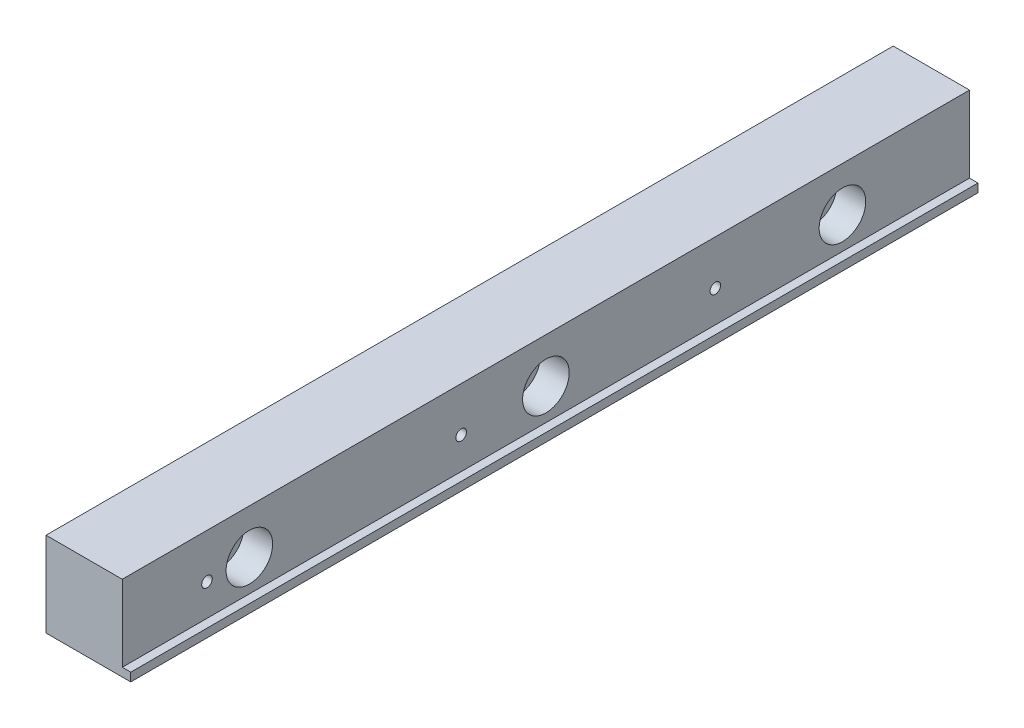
ISO-10303-21;
HEADER;
FILE_DESCRIPTION(('STEP AP214'),'2;1');
FILE_NAME('part.step','',(''),(''),'','','');
FILE_SCHEMA(('AUTOMOTIVE_DESIGN { 1 0 10303 214 1 1 1 1 }'));
ENDSEC;
DATA;
#1=APPLICATION_CONTEXT('core data for automotive mechanical design processes');
#2=APPLICATION_PROTOCOL_DEFINITION('international standard','automotive_design',2000,#1);
#3=PRODUCT_CONTEXT('',#1,'mechanical');
#4=PRODUCT('Part','Part','',(#3));
#5=PRODUCT_RELATED_PRODUCT_CATEGORY('part','',(#4));
#6=PRODUCT_DEFINITION_FORMATION('','',#4);
#7=PRODUCT_DEFINITION_CONTEXT('part definition',#1,'design');
#8=PRODUCT_DEFINITION('design','',#6,#7);
#9=PRODUCT_DEFINITION_SHAPE('','',#8);
#10=(LENGTH_UNIT() NAMED_UNIT(*) SI_UNIT(.MILLI.,.METRE.));
#11=(NAMED_UNIT(*) PLANE_ANGLE_UNIT() SI_UNIT($,.RADIAN.));
#12=(NAMED_UNIT(*) SI_UNIT($,.STERADIAN.) SOLID_ANGLE_UNIT());
#13=UNCERTAINTY_MEASURE_WITH_UNIT(LENGTH_MEASURE(1.E-05),#10,'distance_accuracy_value','');
#14=(GEOMETRIC_REPRESENTATION_CONTEXT(3) GLOBAL_UNCERTAINTY_ASSIGNED_CONTEXT((#13)) GLOBAL_UNIT_ASSIGNED_CONTEXT((#10,
#11,#12)) REPRESENTATION_CONTEXT('',''));
#15=CARTESIAN_POINT('',(0.,0.,0.));
#16=DIRECTION('',(0.,0.,1.));
#17=DIRECTION('',(1.,0.,0.));
#18=AXIS2_PLACEMENT_3D('',#15,#16,#17);
#19=CARTESIAN_POINT('',(0.,0.,200.));
#20=DIRECTION('',(1.,0.,0.));
#21=DIRECTION('',(0.,0.,-1.));
#22=AXIS2_PLACEMENT_3D('',#19,#20,#21);
#23=PLANE('',#22);
#24=CARTESIAN_POINT('',(0.,9.5,170.));
#25=DIRECTION('',(1.,0.,0.));
#26=DIRECTION('',(0.,0.,-1.));
#27=AXIS2_PLACEMENT_3D('',#24,#25,#26);
#28=CIRCLE('',#27,3.3);
#29=CARTESIAN_POINT('',(0.,9.5,166.7));
#30=VERTEX_POINT('',#29);
#31=EDGE_CURVE('E150',#30,#30,#28,.T.);
#32=ORIENTED_EDGE('',*,*,#31,.T.);
#33=EDGE_LOOP('',(#32));
#34=FACE_BOUND('',#33,.T.);
#35=CARTESIAN_POINT('',(0.,9.5,100.));
#36=DIRECTION('',(1.,0.,0.));
#37=DIRECTION('',(0.,0.,-1.));
#38=AXIS2_PLACEMENT_3D('',#35,#36,#37);
#39=CIRCLE('',#38,3.3);
#40=CARTESIAN_POINT('',(0.,9.5,96.7));
#41=VERTEX_POINT('',#40);
#42=EDGE_CURVE('E154',#41,#41,#39,.T.);
#43=ORIENTED_EDGE('',*,*,#42,.T.);
#44=EDGE_LOOP('',(#43));
#45=FACE_BOUND('',#44,.T.);
#46=CARTESIAN_POINT('',(0.,9.5,30.));
#47=DIRECTION('',(1.,0.,0.));
#48=DIRECTION('',(0.,0.,-1.));
#49=AXIS2_PLACEMENT_3D('',#46,#47,#48);
#50=CIRCLE('',#49,3.3);
#51=CARTESIAN_POINT('',(0.,9.5,26.7));
#52=VERTEX_POINT('',#51);
#53=EDGE_CURVE('E157',#52,#52,#50,.T.);
#54=ORIENTED_EDGE('',*,*,#53,.T.);
#55=EDGE_LOOP('',(#54));
#56=FACE_BOUND('',#55,.T.);
#57=DIRECTION('',(0.,-1.,0.));
#58=VECTOR('',#57,1.);
#59=CARTESIAN_POINT('',(0.,0.,0.));
#60=LINE('',#59,#58);
#61=CARTESIAN_POINT('',(0.,20.,0.));
#62=VERTEX_POINT('',#61);
#63=CARTESIAN_POINT('',(0.,0.,0.));
#64=VERTEX_POINT('',#63);
#65=EDGE_CURVE('E103',#62,#64,#60,.T.);
#66=ORIENTED_EDGE('',*,*,#65,.T.);
#67=DIRECTION('',(0.,0.,-1.));
#68=VECTOR('',#67,1.);
#69=CARTESIAN_POINT('',(0.,0.,200.));
#70=LINE('',#69,#68);
#71=CARTESIAN_POINT('',(0.,0.,200.));
#72=VERTEX_POINT('',#71);
#73=EDGE_CURVE('E11',#72,#64,#70,.T.);
#74=ORIENTED_EDGE('',*,*,#73,.F.);
#75=DIRECTION('',(0.,-1.,0.));
#76=VECTOR('',#75,1.);
#77=CARTESIAN_POINT('',(0.,0.,200.));
#78=LINE('',#77,#76);
#79=CARTESIAN_POINT('',(0.,20.,200.));
#80=VERTEX_POINT('',#79);
#81=EDGE_CURVE('E114',#80,#72,#78,.T.);
#82=ORIENTED_EDGE('',*,*,#81,.F.);
#83=DIRECTION('',(0.,0.,-1.));
#84=VECTOR('',#83,1.);
#85=CARTESIAN_POINT('',(0.,20.,200.));
#86=LINE('',#85,#84);
#87=EDGE_CURVE('E99',#80,#62,#86,.T.);
#88=ORIENTED_EDGE('',*,*,#87,.T.);
#89=EDGE_LOOP('',(#66,#74,#82,#88));
#90=FACE_BOUND('',#89,.T.);
#91=ADVANCED_FACE('F16',(#34,#45,#56,#90),#23,.F.);
#92=CARTESIAN_POINT('',(0.,0.,200.));
#93=DIRECTION('',(0.,1.,0.));
#94=DIRECTION('',(0.,0.,1.));
#95=AXIS2_PLACEMENT_3D('',#92,#93,#94);
#96=PLANE('',#95);
#97=DIRECTION('',(1.,0.,0.));
#98=VECTOR('',#97,1.);
#99=CARTESIAN_POINT('',(0.,0.,0.));
#100=LINE('',#99,#98);
#101=CARTESIAN_POINT('',(20.,0.,0.));
#102=VERTEX_POINT('',#101);
#103=EDGE_CURVE('E106',#64,#102,#100,.T.);
#104=ORIENTED_EDGE('',*,*,#103,.T.);
#105=DIRECTION('',(0.,0.,-1.));
#106=VECTOR('',#105,1.);
#107=CARTESIAN_POINT('',(20.,0.,200.));
#108=LINE('',#107,#106);
#109=CARTESIAN_POINT('',(20.,0.,200.));
#110=VERTEX_POINT('',#109);
#111=EDGE_CURVE('E24',#110,#102,#108,.T.);
#112=ORIENTED_EDGE('',*,*,#111,.F.);
#113=DIRECTION('',(1.,0.,0.));
#114=VECTOR('',#113,1.);
#115=CARTESIAN_POINT('',(0.,0.,200.));
#116=LINE('',#115,#114);
#117=EDGE_CURVE('E70',#72,#110,#116,.T.);
#118=ORIENTED_EDGE('',*,*,#117,.F.);
#119=ORIENTED_EDGE('',*,*,#73,.T.);
#120=EDGE_LOOP('',(#104,#112,#118,#119));
#121=FACE_BOUND('',#120,.T.);
#122=ADVANCED_FACE('F141',(#121),#96,.F.);
#123=CARTESIAN_POINT('',(20.,0.,200.));
#124=DIRECTION('',(-1.,0.,0.));
#125=DIRECTION('',(0.,0.,1.));
#126=AXIS2_PLACEMENT_3D('',#123,#124,#125);
#127=PLANE('',#126);
#128=DIRECTION('',(0.,1.,0.));
#129=VECTOR('',#128,1.);
#130=CARTESIAN_POINT('',(20.,0.,0.));
#131=LINE('',#130,#129);
#132=CARTESIAN_POINT('',(20.,2.,0.));
#133=VERTEX_POINT('',#132);
#134=EDGE_CURVE('E109',#102,#133,#131,.T.);
#135=ORIENTED_EDGE('',*,*,#134,.T.);
#136=DIRECTION('',(0.,0.,-1.));
#137=VECTOR('',#136,1.);
#138=CARTESIAN_POINT('',(20.,2.,200.));
#139=LINE('',#138,#137);
#140=CARTESIAN_POINT('',(20.,2.,200.));
#141=VERTEX_POINT('',#140);
#142=EDGE_CURVE('E94',#141,#133,#139,.T.);
#143=ORIENTED_EDGE('',*,*,#142,.F.);
#144=DIRECTION('',(0.,1.,0.));
#145=VECTOR('',#144,1.);
#146=CARTESIAN_POINT('',(20.,0.,200.));
#147=LINE('',#146,#145);
#148=EDGE_CURVE('E85',#110,#141,#147,.T.);
#149=ORIENTED_EDGE('',*,*,#148,.F.);
#150=ORIENTED_EDGE('',*,*,#111,.T.);
#151=EDGE_LOOP('',(#135,#143,#149,#150));
#152=FACE_BOUND('',#151,.T.);
#153=ADVANCED_FACE('F120',(#152),#127,.F.);
#154=CARTESIAN_POINT('',(20.,2.,200.));
#155=DIRECTION('',(0.,-1.,0.));
#156=DIRECTION('',(1.,0.,0.));
#157=AXIS2_PLACEMENT_3D('',#154,#155,#156);
#158=PLANE('',#157);
#159=DIRECTION('',(-1.,0.,0.));
#160=VECTOR('',#159,1.);
#161=CARTESIAN_POINT('',(20.,2.,0.));
#162=LINE('',#161,#160);
#163=CARTESIAN_POINT('',(18.,2.,0.));
#164=VERTEX_POINT('',#163);
#165=EDGE_CURVE('E93',#133,#164,#162,.T.);
#166=ORIENTED_EDGE('',*,*,#165,.T.);
#167=DIRECTION('',(0.,0.,-1.));
#168=VECTOR('',#167,1.);
#169=CARTESIAN_POINT('',(18.,2.,200.));
#170=LINE('',#169,#168);
#171=CARTESIAN_POINT('',(18.,2.,200.));
#172=VERTEX_POINT('',#171);
#173=EDGE_CURVE('E90',#172,#164,#170,.T.);
#174=ORIENTED_EDGE('',*,*,#173,.F.);
#175=DIRECTION('',(-1.,0.,0.));
#176=VECTOR('',#175,1.);
#177=CARTESIAN_POINT('',(20.,2.,200.));
#178=LINE('',#177,#176);
#179=EDGE_CURVE('E79',#141,#172,#178,.T.);
#180=ORIENTED_EDGE('',*,*,#179,.F.);
#181=ORIENTED_EDGE('',*,*,#142,.T.);
#182=EDGE_LOOP('',(#166,#174,#180,#181));
#183=FACE_BOUND('',#182,.T.);
#184=ADVANCED_FACE('F91',(#183),#158,.F.);
#185=CARTESIAN_POINT('',(18.,20.,200.));
#186=DIRECTION('',(-1.,0.,0.));
#187=DIRECTION('',(0.,-1.,0.));
#188=AXIS2_PLACEMENT_3D('',#185,#186,#187);
#189=PLANE('',#188);
#190=CARTESIAN_POINT('',(18.,9.5,170.));
#191=DIRECTION('',(1.,0.,0.));
#192=DIRECTION('',(0.,0.,-1.));
#193=AXIS2_PLACEMENT_3D('',#190,#191,#192);
#194=CIRCLE('',#193,5.5);
#195=CARTESIAN_POINT('',(18.,9.5,164.5));
#196=VERTEX_POINT('',#195);
#197=EDGE_CURVE('E397',#196,#196,#194,.T.);
#198=ORIENTED_EDGE('',*,*,#197,.F.);
#199=EDGE_LOOP('',(#198));
#200=FACE_BOUND('',#199,.T.);
#201=CARTESIAN_POINT('',(18.,9.5,100.));
#202=DIRECTION('',(1.,0.,0.));
#203=DIRECTION('',(0.,0.,-1.));
#204=AXIS2_PLACEMENT_3D('',#201,#202,#203);
#205=CIRCLE('',#204,5.5);
#206=CARTESIAN_POINT('',(18.,9.5,94.5));
#207=VERTEX_POINT('',#206);
#208=EDGE_CURVE('E405',#207,#207,#205,.T.);
#209=ORIENTED_EDGE('',*,*,#208,.F.);
#210=EDGE_LOOP('',(#209));
#211=FACE_BOUND('',#210,.T.);
#212=CARTESIAN_POINT('',(18.,9.5,30.));
#213=DIRECTION('',(1.,0.,0.));
#214=DIRECTION('',(0.,0.,-1.));
#215=AXIS2_PLACEMENT_3D('',#212,#213,#214);
#216=CIRCLE('',#215,5.5);
#217=CARTESIAN_POINT('',(18.,9.5,24.5));
#218=VERTEX_POINT('',#217);
#219=EDGE_CURVE('E415',#218,#218,#216,.T.);
#220=ORIENTED_EDGE('',*,*,#219,.F.);
#221=EDGE_LOOP('',(#220));
#222=FACE_BOUND('',#221,.T.);
#223=CARTESIAN_POINT('',(18.,9.5000005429,180.));
#224=DIRECTION('',(1.,0.,0.));
#225=DIRECTION('',(0.,0.,-1.));
#226=AXIS2_PLACEMENT_3D('',#223,#224,#225);
#227=CIRCLE('',#226,1.25);
#228=CARTESIAN_POINT('',(18.,9.5000005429,178.75));
#229=VERTEX_POINT('',#228);
#230=EDGE_CURVE('E159',#229,#229,#227,.T.);
#231=ORIENTED_EDGE('',*,*,#230,.F.);
#232=EDGE_LOOP('',(#231));
#233=FACE_BOUND('',#232,.T.);
#234=CARTESIAN_POINT('',(18.,9.5000005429,120.));
#235=DIRECTION('',(1.,0.,0.));
#236=DIRECTION('',(0.,0.,-1.));
#237=AXIS2_PLACEMENT_3D('',#234,#235,#236);
#238=CIRCLE('',#237,1.25);
#239=CARTESIAN_POINT('',(18.,9.5000005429,118.75));
#240=VERTEX_POINT('',#239);
#241=EDGE_CURVE('E172',#240,#240,#238,.T.);
#242=ORIENTED_EDGE('',*,*,#241,.F.);
#243=EDGE_LOOP('',(#242));
#244=FACE_BOUND('',#243,.T.);
#245=CARTESIAN_POINT('',(18.,9.5000005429,60.));
#246=DIRECTION('',(1.,0.,0.));
#247=DIRECTION('',(0.,0.,-1.));
#248=AXIS2_PLACEMENT_3D('',#245,#246,#247);
#249=CIRCLE('',#248,1.25);
#250=CARTESIAN_POINT('',(18.,9.5000005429,58.75));
#251=VERTEX_POINT('',#250);
#252=EDGE_CURVE('E178',#251,#251,#249,.T.);
#253=ORIENTED_EDGE('',*,*,#252,.F.);
#254=EDGE_LOOP('',(#253));
#255=FACE_BOUND('',#254,.T.);
#256=DIRECTION('',(0.,1.,0.));
#257=VECTOR('',#256,1.);
#258=CARTESIAN_POINT('',(18.,20.,0.));
#259=LINE('',#258,#257);
#260=CARTESIAN_POINT('',(18.,20.,0.));
#261=VERTEX_POINT('',#260);
#262=EDGE_CURVE('E56',#164,#261,#259,.T.);
#263=ORIENTED_EDGE('',*,*,#262,.T.);
#264=DIRECTION('',(0.,0.,-1.));
#265=VECTOR('',#264,1.);
#266=CARTESIAN_POINT('',(18.,20.,200.));
#267=LINE('',#266,#265);
#268=CARTESIAN_POINT('',(18.,20.,200.));
#269=VERTEX_POINT('',#268);
#270=EDGE_CURVE('E95',#269,#261,#267,.T.);
#271=ORIENTED_EDGE('',*,*,#270,.F.);
#272=DIRECTION('',(0.,1.,0.));
#273=VECTOR('',#272,1.);
#274=CARTESIAN_POINT('',(18.,20.,200.));
#275=LINE('',#274,#273);
#276=EDGE_CURVE('E83',#172,#269,#275,.T.);
#277=ORIENTED_EDGE('',*,*,#276,.F.);
#278=ORIENTED_EDGE('',*,*,#173,.T.);
#279=EDGE_LOOP('',(#263,#271,#277,#278));
#280=FACE_BOUND('',#279,.T.);
#281=ADVANCED_FACE('F97',(#200,#211,#222,#233,#244,#255,#280),#189,.F.);
#282=CARTESIAN_POINT('',(0.,20.,200.));
#283=DIRECTION('',(0.,-1.,0.));
#284=DIRECTION('',(0.,0.,-1.));
#285=AXIS2_PLACEMENT_3D('',#282,#283,#284);
#286=PLANE('',#285);
#287=DIRECTION('',(-1.,0.,0.));
#288=VECTOR('',#287,1.);
#289=CARTESIAN_POINT('',(0.,20.,0.));
#290=LINE('',#289,#288);
#291=EDGE_CURVE('E62',#261,#62,#290,.T.);
#292=ORIENTED_EDGE('',*,*,#291,.T.);
#293=ORIENTED_EDGE('',*,*,#87,.F.);
#294=DIRECTION('',(-1.,0.,0.));
#295=VECTOR('',#294,1.);
#296=CARTESIAN_POINT('',(0.,20.,200.));
#297=LINE('',#296,#295);
#298=EDGE_CURVE('E32',#269,#80,#297,.T.);
#299=ORIENTED_EDGE('',*,*,#298,.F.);
#300=ORIENTED_EDGE('',*,*,#270,.T.);
#301=EDGE_LOOP('',(#292,#293,#299,#300));
#302=FACE_BOUND('',#301,.T.);
#303=ADVANCED_FACE('F127',(#302),#286,.F.);
#304=CARTESIAN_POINT('',(0.,0.,200.));
#305=DIRECTION('',(0.,0.,-1.));
#306=DIRECTION('',(-1.,0.,0.));
#307=AXIS2_PLACEMENT_3D('',#304,#305,#306);
#308=PLANE('',#307);
#309=ORIENTED_EDGE('',*,*,#81,.T.);
#310=ORIENTED_EDGE('',*,*,#117,.T.);
#311=ORIENTED_EDGE('',*,*,#148,.T.);
#312=ORIENTED_EDGE('',*,*,#179,.T.);
#313=ORIENTED_EDGE('',*,*,#276,.T.);
#314=ORIENTED_EDGE('',*,*,#298,.T.);
#315=EDGE_LOOP('',(#309,#310,#311,#312,#313,#314));
#316=FACE_BOUND('',#315,.T.);
#317=ADVANCED_FACE('F81',(#316),#308,.F.);
#318=CARTESIAN_POINT('',(0.,0.,0.));
#319=DIRECTION('',(0.,0.,-1.));
#320=DIRECTION('',(-1.,0.,0.));
#321=AXIS2_PLACEMENT_3D('',#318,#319,#320);
#322=PLANE('',#321);
#323=ORIENTED_EDGE('',*,*,#65,.F.);
#324=ORIENTED_EDGE('',*,*,#291,.F.);
#325=ORIENTED_EDGE('',*,*,#262,.F.);
#326=ORIENTED_EDGE('',*,*,#165,.F.);
#327=ORIENTED_EDGE('',*,*,#134,.F.);
#328=ORIENTED_EDGE('',*,*,#103,.F.);
#329=EDGE_LOOP('',(#323,#324,#325,#326,#327,#328));
#330=FACE_BOUND('',#329,.T.);
#331=ADVANCED_FACE('F123',(#330),#322,.T.);
#332=CARTESIAN_POINT('',(4.5,9.5000005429,60.));
#333=DIRECTION('',(1.,0.,0.));
#334=DIRECTION('',(0.,0.,-1.));
#335=AXIS2_PLACEMENT_3D('',#332,#333,#334);
#336=CONICAL_SURFACE('',#335,1.25,1.02974425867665);
#337=CARTESIAN_POINT('',(3.74892422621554,9.5000005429,60.));
#338=VERTEX_POINT('',#337);
#339=VERTEX_LOOP('',#338);
#340=FACE_BOUND('',#339,.T.);
#341=CARTESIAN_POINT('',(4.5,9.5000005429,60.));
#342=DIRECTION('',(1.,0.,0.));
#343=DIRECTION('',(0.,0.,-1.));
#344=AXIS2_PLACEMENT_3D('',#341,#342,#343);
#345=CIRCLE('',#344,1.25);
#346=CARTESIAN_POINT('',(4.5,9.5000005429,58.75));
#347=VERTEX_POINT('',#346);
#348=EDGE_CURVE('E107',#347,#347,#345,.T.);
#349=ORIENTED_EDGE('',*,*,#348,.T.);
#350=EDGE_LOOP('',(#349));
#351=FACE_BOUND('',#350,.T.);
#352=ADVANCED_FACE('F186',(#340,#351),#336,.F.);
#353=CARTESIAN_POINT('',(18.,9.5000005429,60.));
#354=DIRECTION('',(1.,0.,0.));
#355=DIRECTION('',(0.,0.,-1.));
#356=AXIS2_PLACEMENT_3D('',#353,#354,#355);
#357=CYLINDRICAL_SURFACE('',#356,1.25);
#358=ORIENTED_EDGE('',*,*,#348,.F.);
#359=EDGE_LOOP('',(#358));
#360=FACE_BOUND('',#359,.T.);
#361=ORIENTED_EDGE('',*,*,#252,.T.);
#362=EDGE_LOOP('',(#361));
#363=FACE_BOUND('',#362,.T.);
#364=ADVANCED_FACE('F188',(#360,#363),#357,.F.);
#365=CARTESIAN_POINT('',(4.5,9.5000005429,120.));
#366=DIRECTION('',(1.,0.,0.));
#367=DIRECTION('',(0.,0.,-1.));
#368=AXIS2_PLACEMENT_3D('',#365,#366,#367);
#369=CONICAL_SURFACE('',#368,1.25,1.02974425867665);
#370=CARTESIAN_POINT('',(3.74892422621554,9.5000005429,120.));
#371=VERTEX_POINT('',#370);
#372=VERTEX_LOOP('',#371);
#373=FACE_BOUND('',#372,.T.);
#374=CARTESIAN_POINT('',(4.5,9.5000005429,120.));
#375=DIRECTION('',(1.,0.,0.));
#376=DIRECTION('',(0.,0.,-1.));
#377=AXIS2_PLACEMENT_3D('',#374,#375,#376);
#378=CIRCLE('',#377,1.25);
#379=CARTESIAN_POINT('',(4.5,9.5000005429,118.75));
#380=VERTEX_POINT('',#379);
#381=EDGE_CURVE('E175',#380,#380,#378,.T.);
#382=ORIENTED_EDGE('',*,*,#381,.T.);
#383=EDGE_LOOP('',(#382));
#384=FACE_BOUND('',#383,.T.);
#385=ADVANCED_FACE('F191',(#373,#384),#369,.F.);
#386=CARTESIAN_POINT('',(18.,9.5000005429,120.));
#387=DIRECTION('',(1.,0.,0.));
#388=DIRECTION('',(0.,0.,-1.));
#389=AXIS2_PLACEMENT_3D('',#386,#387,#388);
#390=CYLINDRICAL_SURFACE('',#389,1.25);
#391=ORIENTED_EDGE('',*,*,#381,.F.);
#392=EDGE_LOOP('',(#391));
#393=FACE_BOUND('',#392,.T.);
#394=ORIENTED_EDGE('',*,*,#241,.T.);
#395=EDGE_LOOP('',(#394));
#396=FACE_BOUND('',#395,.T.);
#397=ADVANCED_FACE('F200',(#393,#396),#390,.F.);
#398=CARTESIAN_POINT('',(4.5,9.5000005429,180.));
#399=DIRECTION('',(1.,0.,0.));
#400=DIRECTION('',(0.,0.,-1.));
#401=AXIS2_PLACEMENT_3D('',#398,#399,#400);
#402=CONICAL_SURFACE('',#401,1.25,1.02974425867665);
#403=CARTESIAN_POINT('',(3.74892422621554,9.5000005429,180.));
#404=VERTEX_POINT('',#403);
#405=VERTEX_LOOP('',#404);
#406=FACE_BOUND('',#405,.T.);
#407=CARTESIAN_POINT('',(4.5,9.5000005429,180.));
#408=DIRECTION('',(1.,0.,0.));
#409=DIRECTION('',(0.,0.,-1.));
#410=AXIS2_PLACEMENT_3D('',#407,#408,#409);
#411=CIRCLE('',#410,1.25);
#412=CARTESIAN_POINT('',(4.5,9.5000005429,178.75));
#413=VERTEX_POINT('',#412);
#414=EDGE_CURVE('E163',#413,#413,#411,.T.);
#415=ORIENTED_EDGE('',*,*,#414,.T.);
#416=EDGE_LOOP('',(#415));
#417=FACE_BOUND('',#416,.T.);
#418=ADVANCED_FACE('F241',(#406,#417),#402,.F.);
#419=CARTESIAN_POINT('',(18.,9.5000005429,180.));
#420=DIRECTION('',(1.,0.,0.));
#421=DIRECTION('',(0.,0.,-1.));
#422=AXIS2_PLACEMENT_3D('',#419,#420,#421);
#423=CYLINDRICAL_SURFACE('',#422,1.25);
#424=ORIENTED_EDGE('',*,*,#414,.F.);
#425=EDGE_LOOP('',(#424));
#426=FACE_BOUND('',#425,.T.);
#427=ORIENTED_EDGE('',*,*,#230,.T.);
#428=EDGE_LOOP('',(#427));
#429=FACE_BOUND('',#428,.T.);
#430=ADVANCED_FACE('F250',(#426,#429),#423,.F.);
#431=CARTESIAN_POINT('',(18.,9.5,30.));
#432=DIRECTION('',(1.,0.,0.));
#433=DIRECTION('',(0.,0.,-1.));
#434=AXIS2_PLACEMENT_3D('',#431,#432,#433);
#435=CYLINDRICAL_SURFACE('',#434,3.3);
#436=ORIENTED_EDGE('',*,*,#53,.F.);
#437=EDGE_LOOP('',(#436));
#438=FACE_BOUND('',#437,.T.);
#439=CARTESIAN_POINT('',(11.2,9.5,30.));
#440=DIRECTION('',(1.,0.,0.));
#441=DIRECTION('',(0.,0.,-1.));
#442=AXIS2_PLACEMENT_3D('',#439,#440,#441);
#443=CIRCLE('',#442,3.3);
#444=CARTESIAN_POINT('',(11.2,9.5,26.7));
#445=VERTEX_POINT('',#444);
#446=EDGE_CURVE('E160',#445,#445,#443,.T.);
#447=ORIENTED_EDGE('',*,*,#446,.T.);
#448=EDGE_LOOP('',(#447));
#449=FACE_BOUND('',#448,.T.);
#450=ADVANCED_FACE('F260',(#438,#449),#435,.F.);
#451=CARTESIAN_POINT('',(11.2,12.8,30.));
#452=DIRECTION('',(-1.,0.,0.));
#453=DIRECTION('',(0.,0.,1.));
#454=AXIS2_PLACEMENT_3D('',#451,#452,#453);
#455=PLANE('',#454);
#456=ORIENTED_EDGE('',*,*,#446,.F.);
#457=EDGE_LOOP('',(#456));
#458=FACE_BOUND('',#457,.T.);
#459=CARTESIAN_POINT('',(11.2,9.5,30.));
#460=DIRECTION('',(1.,0.,0.));
#461=DIRECTION('',(0.,0.,-1.));
#462=AXIS2_PLACEMENT_3D('',#459,#460,#461);
#463=CIRCLE('',#462,5.5);
#464=CARTESIAN_POINT('',(11.2,9.5,24.5));
#465=VERTEX_POINT('',#464);
#466=EDGE_CURVE('E166',#465,#465,#463,.T.);
#467=ORIENTED_EDGE('',*,*,#466,.T.);
#468=EDGE_LOOP('',(#467));
#469=FACE_BOUND('',#468,.T.);
#470=ADVANCED_FACE('F270',(#458,#469),#455,.F.);
#471=CARTESIAN_POINT('',(18.,9.5,30.));
#472=DIRECTION('',(1.,0.,0.));
#473=DIRECTION('',(0.,0.,-1.));
#474=AXIS2_PLACEMENT_3D('',#471,#472,#473);
#475=CYLINDRICAL_SURFACE('',#474,5.5);
#476=ORIENTED_EDGE('',*,*,#466,.F.);
#477=EDGE_LOOP('',(#476));
#478=FACE_BOUND('',#477,.T.);
#479=ORIENTED_EDGE('',*,*,#219,.T.);
#480=EDGE_LOOP('',(#479));
#481=FACE_BOUND('',#480,.T.);
#482=ADVANCED_FACE('F279',(#478,#481),#475,.F.);
#483=CARTESIAN_POINT('',(18.,9.5,100.));
#484=DIRECTION('',(1.,0.,0.));
#485=DIRECTION('',(0.,0.,-1.));
#486=AXIS2_PLACEMENT_3D('',#483,#484,#485);
#487=CYLINDRICAL_SURFACE('',#486,3.3);
#488=ORIENTED_EDGE('',*,*,#42,.F.);
#489=EDGE_LOOP('',(#488));
#490=FACE_BOUND('',#489,.T.);
#491=CARTESIAN_POINT('',(11.2,9.5,100.));
#492=DIRECTION('',(1.,0.,0.));
#493=DIRECTION('',(0.,0.,-1.));
#494=AXIS2_PLACEMENT_3D('',#491,#492,#493);
#495=CIRCLE('',#494,3.3);
#496=CARTESIAN_POINT('',(11.2,9.5,96.7));
#497=VERTEX_POINT('',#496);
#498=EDGE_CURVE('E411',#497,#497,#495,.T.);
#499=ORIENTED_EDGE('',*,*,#498,.T.);
#500=EDGE_LOOP('',(#499));
#501=FACE_BOUND('',#500,.T.);
#502=ADVANCED_FACE('F289',(#490,#501),#487,.F.);
#503=CARTESIAN_POINT('',(11.2,12.8,100.));
#504=DIRECTION('',(-1.,0.,0.));
#505=DIRECTION('',(0.,0.,1.));
#506=AXIS2_PLACEMENT_3D('',#503,#504,#505);
#507=PLANE('',#506);
#508=ORIENTED_EDGE('',*,*,#498,.F.);
#509=EDGE_LOOP('',(#508));
#510=FACE_BOUND('',#509,.T.);
#511=CARTESIAN_POINT('',(11.2,9.5,100.));
#512=DIRECTION('',(1.,0.,0.));
#513=DIRECTION('',(0.,0.,-1.));
#514=AXIS2_PLACEMENT_3D('',#511,#512,#513);
#515=CIRCLE('',#514,5.5);
#516=CARTESIAN_POINT('',(11.2,9.5,94.5));
#517=VERTEX_POINT('',#516);
#518=EDGE_CURVE('E408',#517,#517,#515,.T.);
#519=ORIENTED_EDGE('',*,*,#518,.T.);
#520=EDGE_LOOP('',(#519));
#521=FACE_BOUND('',#520,.T.);
#522=ADVANCED_FACE('F299',(#510,#521),#507,.F.);
#523=CARTESIAN_POINT('',(18.,9.5,100.));
#524=DIRECTION('',(1.,0.,0.));
#525=DIRECTION('',(0.,0.,-1.));
#526=AXIS2_PLACEMENT_3D('',#523,#524,#525);
#527=CYLINDRICAL_SURFACE('',#526,5.5);
#528=ORIENTED_EDGE('',*,*,#518,.F.);
#529=EDGE_LOOP('',(#528));
#530=FACE_BOUND('',#529,.T.);
#531=ORIENTED_EDGE('',*,*,#208,.T.);
#532=EDGE_LOOP('',(#531));
#533=FACE_BOUND('',#532,.T.);
#534=ADVANCED_FACE('F309',(#530,#533),#527,.F.);
#535=CARTESIAN_POINT('',(18.,9.5,170.));
#536=DIRECTION('',(1.,0.,0.));
#537=DIRECTION('',(0.,0.,-1.));
#538=AXIS2_PLACEMENT_3D('',#535,#536,#537);
#539=CYLINDRICAL_SURFACE('',#538,3.3);
#540=ORIENTED_EDGE('',*,*,#31,.F.);
#541=EDGE_LOOP('',(#540));
#542=FACE_BOUND('',#541,.T.);
#543=CARTESIAN_POINT('',(11.2,9.5,170.));
#544=DIRECTION('',(1.,0.,0.));
#545=DIRECTION('',(0.,0.,-1.));
#546=AXIS2_PLACEMENT_3D('',#543,#544,#545);
#547=CIRCLE('',#546,3.3);
#548=CARTESIAN_POINT('',(11.2,9.5,166.7));
#549=VERTEX_POINT('',#548);
#550=EDGE_CURVE('E399',#549,#549,#547,.T.);
#551=ORIENTED_EDGE('',*,*,#550,.T.);
#552=EDGE_LOOP('',(#551));
#553=FACE_BOUND('',#552,.T.);
#554=ADVANCED_FACE('F319',(#542,#553),#539,.F.);
#555=CARTESIAN_POINT('',(11.2,12.8,170.));
#556=DIRECTION('',(-1.,0.,0.));
#557=DIRECTION('',(0.,0.,1.));
#558=AXIS2_PLACEMENT_3D('',#555,#556,#557);
#559=PLANE('',#558);
#560=ORIENTED_EDGE('',*,*,#550,.F.);
#561=EDGE_LOOP('',(#560));
#562=FACE_BOUND('',#561,.T.);
#563=CARTESIAN_POINT('',(11.2,9.5,170.));
#564=DIRECTION('',(1.,0.,0.));
#565=DIRECTION('',(0.,0.,-1.));
#566=AXIS2_PLACEMENT_3D('',#563,#564,#565);
#567=CIRCLE('',#566,5.5);
#568=CARTESIAN_POINT('',(11.2,9.5,164.5));
#569=VERTEX_POINT('',#568);
#570=EDGE_CURVE('E394',#569,#569,#567,.T.);
#571=ORIENTED_EDGE('',*,*,#570,.T.);
#572=EDGE_LOOP('',(#571));
#573=FACE_BOUND('',#572,.T.);
#574=ADVANCED_FACE('F329',(#562,#573),#559,.F.);
#575=CARTESIAN_POINT('',(18.,9.5,170.));
#576=DIRECTION('',(1.,0.,0.));
#577=DIRECTION('',(0.,0.,-1.));
#578=AXIS2_PLACEMENT_3D('',#575,#576,#577);
#579=CYLINDRICAL_SURFACE('',#578,5.5);
#580=ORIENTED_EDGE('',*,*,#570,.F.);
#581=EDGE_LOOP('',(#580));
#582=FACE_BOUND('',#581,.T.);
#583=ORIENTED_EDGE('',*,*,#197,.T.);
#584=EDGE_LOOP('',(#583));
#585=FACE_BOUND('',#584,.T.);
#586=ADVANCED_FACE('F339',(#582,#585),#579,.F.);
#587=CLOSED_SHELL('',(#91,#122,#153,#184,#281,#303,#317,#331,#352,#364,#385,#397,#418,#430,#450,
#470,#482,#502,#522,#534,#554,#574,#586));
#588=MANIFOLD_SOLID_BREP('B1',#587);
#589=ADVANCED_BREP_SHAPE_REPRESENTATION('',(#18,#588),#14);
#590=SHAPE_DEFINITION_REPRESENTATION(#9,#589);
ENDSEC;
END-ISO-10303-21;
